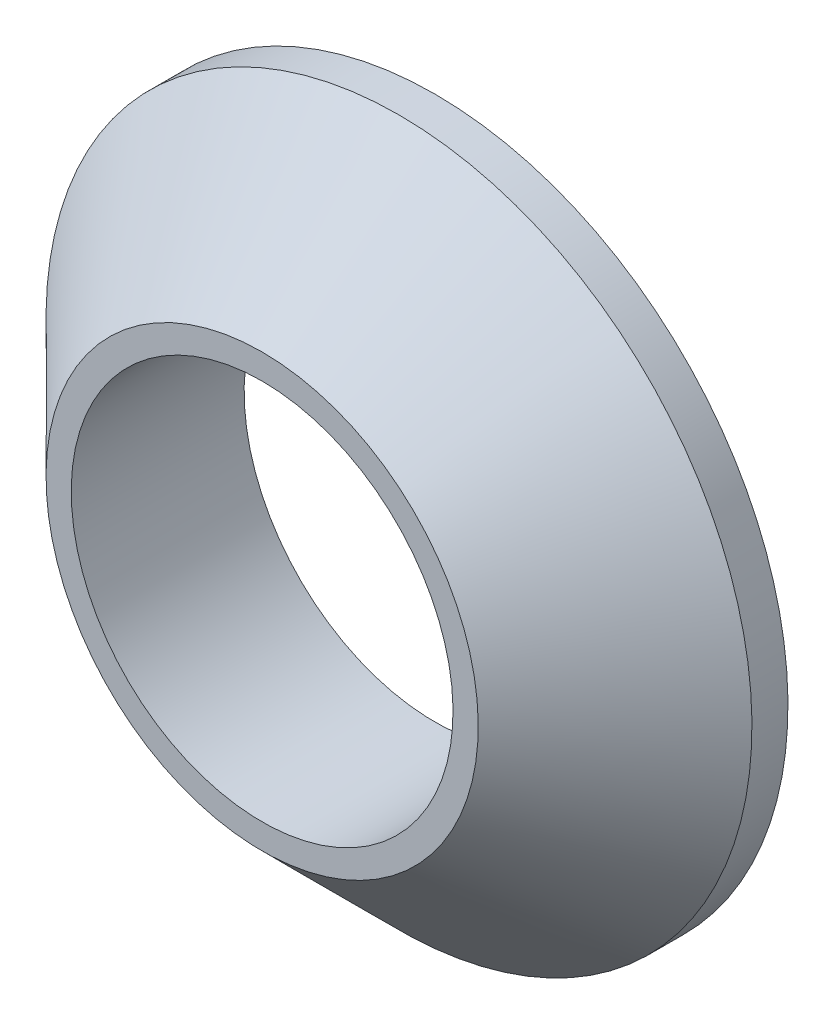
ISO-10303-21;
HEADER;
FILE_DESCRIPTION(('STEP AP214'),'2;1');
FILE_NAME('part.step','',(''),(''),'','','');
FILE_SCHEMA(('AUTOMOTIVE_DESIGN { 1 0 10303 214 1 1 1 1 }'));
ENDSEC;
DATA;
#1=APPLICATION_CONTEXT('core data for automotive mechanical design processes');
#2=APPLICATION_PROTOCOL_DEFINITION('international standard','automotive_design',2000,#1);
#3=PRODUCT_CONTEXT('',#1,'mechanical');
#4=PRODUCT('Part','Part','',(#3));
#5=PRODUCT_RELATED_PRODUCT_CATEGORY('part','',(#4));
#6=PRODUCT_DEFINITION_FORMATION('','',#4);
#7=PRODUCT_DEFINITION_CONTEXT('part definition',#1,'design');
#8=PRODUCT_DEFINITION('design','',#6,#7);
#9=PRODUCT_DEFINITION_SHAPE('','',#8);
#10=(LENGTH_UNIT() NAMED_UNIT(*) SI_UNIT(.MILLI.,.METRE.));
#11=(NAMED_UNIT(*) PLANE_ANGLE_UNIT() SI_UNIT($,.RADIAN.));
#12=(NAMED_UNIT(*) SI_UNIT($,.STERADIAN.) SOLID_ANGLE_UNIT());
#13=UNCERTAINTY_MEASURE_WITH_UNIT(LENGTH_MEASURE(1.E-05),#10,'distance_accuracy_value','');
#14=(GEOMETRIC_REPRESENTATION_CONTEXT(3) GLOBAL_UNCERTAINTY_ASSIGNED_CONTEXT((#13)) GLOBAL_UNIT_ASSIGNED_CONTEXT((#10,
#11,#12)) REPRESENTATION_CONTEXT('',''));
#15=CARTESIAN_POINT('',(0.,0.,0.));
#16=DIRECTION('',(0.,0.,1.));
#17=DIRECTION('',(1.,0.,0.));
#18=AXIS2_PLACEMENT_3D('',#15,#16,#17);
#19=CARTESIAN_POINT('',(4.9,0.,0.));
#20=DIRECTION('',(0.,0.,-1.));
#21=DIRECTION('',(0.,1.,0.));
#22=AXIS2_PLACEMENT_3D('',#19,#20,#21);
#23=PLANE('',#22);
#24=CARTESIAN_POINT('',(0.,0.,0.));
#25=DIRECTION('',(0.,0.,-1.));
#26=DIRECTION('',(0.,1.,0.));
#27=AXIS2_PLACEMENT_3D('',#24,#25,#26);
#28=CIRCLE('',#27,4.9);
#29=CARTESIAN_POINT('',(0.,4.9,0.));
#30=VERTEX_POINT('',#29);
#31=EDGE_CURVE('E31',#30,#30,#28,.T.);
#32=ORIENTED_EDGE('',*,*,#31,.T.);
#33=EDGE_LOOP('',(#32));
#34=FACE_BOUND('',#33,.T.);
#35=CARTESIAN_POINT('',(0.,0.,0.));
#36=DIRECTION('',(0.,0.,-1.));
#37=DIRECTION('',(0.,1.,0.));
#38=AXIS2_PLACEMENT_3D('',#35,#36,#37);
#39=CIRCLE('',#38,2.65);
#40=CARTESIAN_POINT('',(0.,2.65,0.));
#41=VERTEX_POINT('',#40);
#42=EDGE_CURVE('E8',#41,#41,#39,.T.);
#43=ORIENTED_EDGE('',*,*,#42,.F.);
#44=EDGE_LOOP('',(#43));
#45=FACE_BOUND('',#44,.T.);
#46=ADVANCED_FACE('F12',(#34,#45),#23,.T.);
#47=CARTESIAN_POINT('',(0.,0.,0.));
#48=DIRECTION('',(0.,0.,-1.));
#49=DIRECTION('',(0.,1.,0.));
#50=AXIS2_PLACEMENT_3D('',#47,#48,#49);
#51=CYLINDRICAL_SURFACE('',#50,2.65);
#52=ORIENTED_EDGE('',*,*,#42,.T.);
#53=EDGE_LOOP('',(#52));
#54=FACE_BOUND('',#53,.T.);
#55=CARTESIAN_POINT('',(0.,0.,2.4));
#56=DIRECTION('',(0.,0.,-1.));
#57=DIRECTION('',(0.,1.,0.));
#58=AXIS2_PLACEMENT_3D('',#55,#56,#57);
#59=CIRCLE('',#58,2.65);
#60=CARTESIAN_POINT('',(0.,2.65,2.4));
#61=VERTEX_POINT('',#60);
#62=EDGE_CURVE('E18',#61,#61,#59,.T.);
#63=ORIENTED_EDGE('',*,*,#62,.F.);
#64=EDGE_LOOP('',(#63));
#65=FACE_BOUND('',#64,.T.);
#66=ADVANCED_FACE('F51',(#54,#65),#51,.F.);
#67=CARTESIAN_POINT('',(2.65,0.,2.4));
#68=DIRECTION('',(0.,0.,1.));
#69=DIRECTION('',(0.,-1.,0.));
#70=AXIS2_PLACEMENT_3D('',#67,#68,#69);
#71=PLANE('',#70);
#72=ORIENTED_EDGE('',*,*,#62,.T.);
#73=EDGE_LOOP('',(#72));
#74=FACE_BOUND('',#73,.T.);
#75=CARTESIAN_POINT('',(0.,0.,2.4));
#76=DIRECTION('',(0.,0.,-1.));
#77=DIRECTION('',(0.,1.,0.));
#78=AXIS2_PLACEMENT_3D('',#75,#76,#77);
#79=CIRCLE('',#78,3.);
#80=CARTESIAN_POINT('',(0.,3.,2.4));
#81=VERTEX_POINT('',#80);
#82=EDGE_CURVE('E22',#81,#81,#79,.T.);
#83=ORIENTED_EDGE('',*,*,#82,.F.);
#84=EDGE_LOOP('',(#83));
#85=FACE_BOUND('',#84,.T.);
#86=ADVANCED_FACE('F47',(#74,#85),#71,.T.);
#87=CARTESIAN_POINT('',(0.,0.,0.5));
#88=DIRECTION('',(0.,0.,-1.));
#89=DIRECTION('',(0.,1.,0.));
#90=AXIS2_PLACEMENT_3D('',#87,#88,#89);
#91=CONICAL_SURFACE('',#90,4.9,0.785398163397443);
#92=ORIENTED_EDGE('',*,*,#82,.T.);
#93=EDGE_LOOP('',(#92));
#94=FACE_BOUND('',#93,.T.);
#95=CARTESIAN_POINT('',(0.,0.,0.5));
#96=DIRECTION('',(0.,0.,-1.));
#97=DIRECTION('',(0.,1.,0.));
#98=AXIS2_PLACEMENT_3D('',#95,#96,#97);
#99=CIRCLE('',#98,4.9);
#100=CARTESIAN_POINT('',(0.,4.9,0.5));
#101=VERTEX_POINT('',#100);
#102=EDGE_CURVE('E26',#101,#101,#99,.T.);
#103=ORIENTED_EDGE('',*,*,#102,.F.);
#104=EDGE_LOOP('',(#103));
#105=FACE_BOUND('',#104,.T.);
#106=ADVANCED_FACE('F39',(#94,#105),#91,.T.);
#107=CARTESIAN_POINT('',(0.,0.,0.));
#108=DIRECTION('',(0.,0.,-1.));
#109=DIRECTION('',(0.,1.,0.));
#110=AXIS2_PLACEMENT_3D('',#107,#108,#109);
#111=CYLINDRICAL_SURFACE('',#110,4.9);
#112=ORIENTED_EDGE('',*,*,#102,.T.);
#113=EDGE_LOOP('',(#112));
#114=FACE_BOUND('',#113,.T.);
#115=ORIENTED_EDGE('',*,*,#31,.F.);
#116=EDGE_LOOP('',(#115));
#117=FACE_BOUND('',#116,.T.);
#118=ADVANCED_FACE('F37',(#114,#117),#111,.T.);
#119=CLOSED_SHELL('',(#46,#66,#86,#106,#118));
#120=MANIFOLD_SOLID_BREP('B1',#119);
#121=ADVANCED_BREP_SHAPE_REPRESENTATION('',(#18,#120),#14);
#122=SHAPE_DEFINITION_REPRESENTATION(#9,#121);
ENDSEC;
END-ISO-10303-21;
